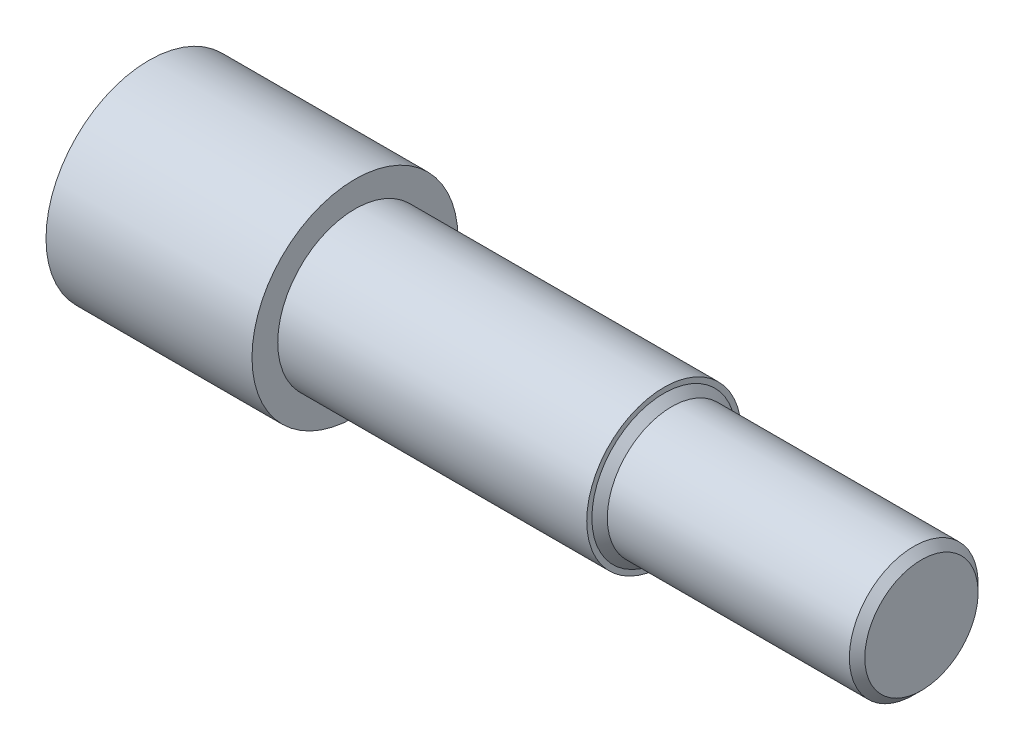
from build123d import *

# Parameters (mm, degrees)
SKETCH_2_W          = 30
SKETCH_2_H          = 8
CUT_EXTRUDE_1_DEPTH = 19
CHAMFER_1_SIZE      = 1.5


with BuildPart() as part:
    # Sketch 1 → Revolve 1 (revolve)
    with BuildSketch(Plane.XY, mode=Mode.PRIVATE) as revolve_1_sk:
        Polygon((0, 0), (0, 20), (40, 20), (40, 15), (100, 15), (100, 12.5), (150, 12.5), (150, 0), align=None)
    revolve(revolve_1_sk.sketch.rotate(Axis((0, 0, 0), (1, 0, 0)), 90), axis=Axis((0, 0, 0), (1, 0, 0)))

    # Sketch 2 → Cut-Extrude 1 (cut)
    with BuildSketch(Plane(origin=(0, 0, 0), x_dir=(1, 0, 0), z_dir=(0, 1, 0))):
        with Locations((65, 0)):
            Rectangle(SKETCH_2_W, SKETCH_2_H)
    extrude(amount=-CUT_EXTRUDE_1_DEPTH, mode=Mode.SUBTRACT)

    # Chamfer 1
    chamfer_1_edges = [part.edges().sort_by_distance(p)[0] for p in [
        (150, 0, -12.5),
        (100, 0, -12.5),
    ]]
    chamfer(chamfer_1_edges, length=CHAMFER_1_SIZE)


solid = part.part
